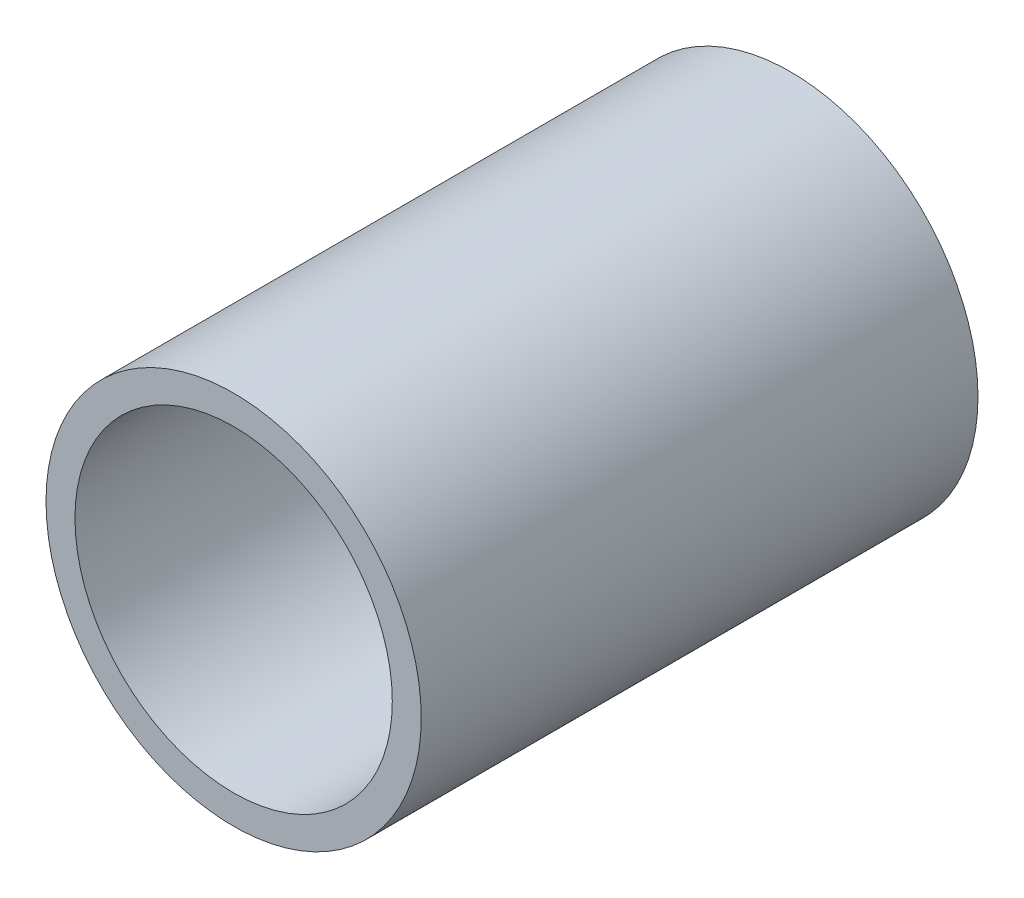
ISO-10303-21;
HEADER;
FILE_DESCRIPTION(('STEP AP214'),'2;1');
FILE_NAME('part.step','',(''),(''),'','','');
FILE_SCHEMA(('AUTOMOTIVE_DESIGN { 1 0 10303 214 1 1 1 1 }'));
ENDSEC;
DATA;
#1=APPLICATION_CONTEXT('core data for automotive mechanical design processes');
#2=APPLICATION_PROTOCOL_DEFINITION('international standard','automotive_design',2000,#1);
#3=PRODUCT_CONTEXT('',#1,'mechanical');
#4=PRODUCT('Part','Part','',(#3));
#5=PRODUCT_RELATED_PRODUCT_CATEGORY('part','',(#4));
#6=PRODUCT_DEFINITION_FORMATION('','',#4);
#7=PRODUCT_DEFINITION_CONTEXT('part definition',#1,'design');
#8=PRODUCT_DEFINITION('design','',#6,#7);
#9=PRODUCT_DEFINITION_SHAPE('','',#8);
#10=(LENGTH_UNIT() NAMED_UNIT(*) SI_UNIT(.MILLI.,.METRE.));
#11=(NAMED_UNIT(*) PLANE_ANGLE_UNIT() SI_UNIT($,.RADIAN.));
#12=(NAMED_UNIT(*) SI_UNIT($,.STERADIAN.) SOLID_ANGLE_UNIT());
#13=UNCERTAINTY_MEASURE_WITH_UNIT(LENGTH_MEASURE(1.E-05),#10,'distance_accuracy_value','');
#14=(GEOMETRIC_REPRESENTATION_CONTEXT(3) GLOBAL_UNCERTAINTY_ASSIGNED_CONTEXT((#13)) GLOBAL_UNIT_ASSIGNED_CONTEXT((#10,
#11,#12)) REPRESENTATION_CONTEXT('',''));
#15=CARTESIAN_POINT('',(0.,0.,0.));
#16=DIRECTION('',(0.,0.,1.));
#17=DIRECTION('',(1.,0.,0.));
#18=AXIS2_PLACEMENT_3D('',#15,#16,#17);
#19=CARTESIAN_POINT('',(0.,0.,50.));
#20=DIRECTION('',(0.,0.,1.));
#21=DIRECTION('',(1.,0.,0.));
#22=AXIS2_PLACEMENT_3D('',#19,#20,#21);
#23=PLANE('',#22);
#24=CARTESIAN_POINT('',(0.,0.,50.));
#25=DIRECTION('',(0.,0.,1.));
#26=DIRECTION('',(1.,0.,0.));
#27=AXIS2_PLACEMENT_3D('',#24,#25,#26);
#28=CIRCLE('',#27,16.85);
#29=CARTESIAN_POINT('',(16.85,0.,50.));
#30=VERTEX_POINT('',#29);
#31=EDGE_CURVE('E10',#30,#30,#28,.T.);
#32=ORIENTED_EDGE('',*,*,#31,.T.);
#33=EDGE_LOOP('',(#32));
#34=FACE_BOUND('',#33,.T.);
#35=CARTESIAN_POINT('',(0.,0.,50.));
#36=DIRECTION('',(0.,0.,1.));
#37=DIRECTION('',(1.,0.,0.));
#38=AXIS2_PLACEMENT_3D('',#35,#36,#37);
#39=CIRCLE('',#38,14.25);
#40=CARTESIAN_POINT('',(14.25,0.,50.));
#41=VERTEX_POINT('',#40);
#42=EDGE_CURVE('E37',#41,#41,#39,.T.);
#43=ORIENTED_EDGE('',*,*,#42,.F.);
#44=EDGE_LOOP('',(#43));
#45=FACE_BOUND('',#44,.T.);
#46=ADVANCED_FACE('F26',(#34,#45),#23,.T.);
#47=CARTESIAN_POINT('',(0.,0.,0.));
#48=DIRECTION('',(0.,0.,1.));
#49=DIRECTION('',(1.,0.,0.));
#50=AXIS2_PLACEMENT_3D('',#47,#48,#49);
#51=PLANE('',#50);
#52=CARTESIAN_POINT('',(0.,0.,0.));
#53=DIRECTION('',(0.,0.,1.));
#54=DIRECTION('',(1.,0.,0.));
#55=AXIS2_PLACEMENT_3D('',#52,#53,#54);
#56=CIRCLE('',#55,16.85);
#57=CARTESIAN_POINT('',(16.85,0.,0.));
#58=VERTEX_POINT('',#57);
#59=EDGE_CURVE('E33',#58,#58,#56,.T.);
#60=ORIENTED_EDGE('',*,*,#59,.F.);
#61=EDGE_LOOP('',(#60));
#62=FACE_BOUND('',#61,.T.);
#63=CARTESIAN_POINT('',(0.,0.,0.));
#64=DIRECTION('',(0.,0.,1.));
#65=DIRECTION('',(1.,0.,0.));
#66=AXIS2_PLACEMENT_3D('',#63,#64,#65);
#67=CIRCLE('',#66,14.25);
#68=CARTESIAN_POINT('',(14.25,0.,0.));
#69=VERTEX_POINT('',#68);
#70=EDGE_CURVE('E41',#69,#69,#67,.T.);
#71=ORIENTED_EDGE('',*,*,#70,.T.);
#72=EDGE_LOOP('',(#71));
#73=FACE_BOUND('',#72,.T.);
#74=ADVANCED_FACE('F47',(#62,#73),#51,.F.);
#75=CARTESIAN_POINT('',(0.,0.,50.));
#76=DIRECTION('',(0.,0.,-1.));
#77=DIRECTION('',(-1.,0.,0.));
#78=AXIS2_PLACEMENT_3D('',#75,#76,#77);
#79=CYLINDRICAL_SURFACE('',#78,16.85);
#80=ORIENTED_EDGE('',*,*,#31,.F.);
#81=EDGE_LOOP('',(#80));
#82=FACE_BOUND('',#81,.T.);
#83=ORIENTED_EDGE('',*,*,#59,.T.);
#84=EDGE_LOOP('',(#83));
#85=FACE_BOUND('',#84,.T.);
#86=ADVANCED_FACE('F28',(#82,#85),#79,.T.);
#87=CARTESIAN_POINT('',(0.,0.,50.));
#88=DIRECTION('',(0.,0.,-1.));
#89=DIRECTION('',(-1.,0.,0.));
#90=AXIS2_PLACEMENT_3D('',#87,#88,#89);
#91=CYLINDRICAL_SURFACE('',#90,14.25);
#92=ORIENTED_EDGE('',*,*,#42,.T.);
#93=EDGE_LOOP('',(#92));
#94=FACE_BOUND('',#93,.T.);
#95=ORIENTED_EDGE('',*,*,#70,.F.);
#96=EDGE_LOOP('',(#95));
#97=FACE_BOUND('',#96,.T.);
#98=ADVANCED_FACE('F49',(#94,#97),#91,.F.);
#99=CLOSED_SHELL('',(#46,#74,#86,#98));
#100=MANIFOLD_SOLID_BREP('B2',#99);
#101=ADVANCED_BREP_SHAPE_REPRESENTATION('',(#18,#100),#14);
#102=SHAPE_DEFINITION_REPRESENTATION(#9,#101);
ENDSEC;
END-ISO-10303-21;
